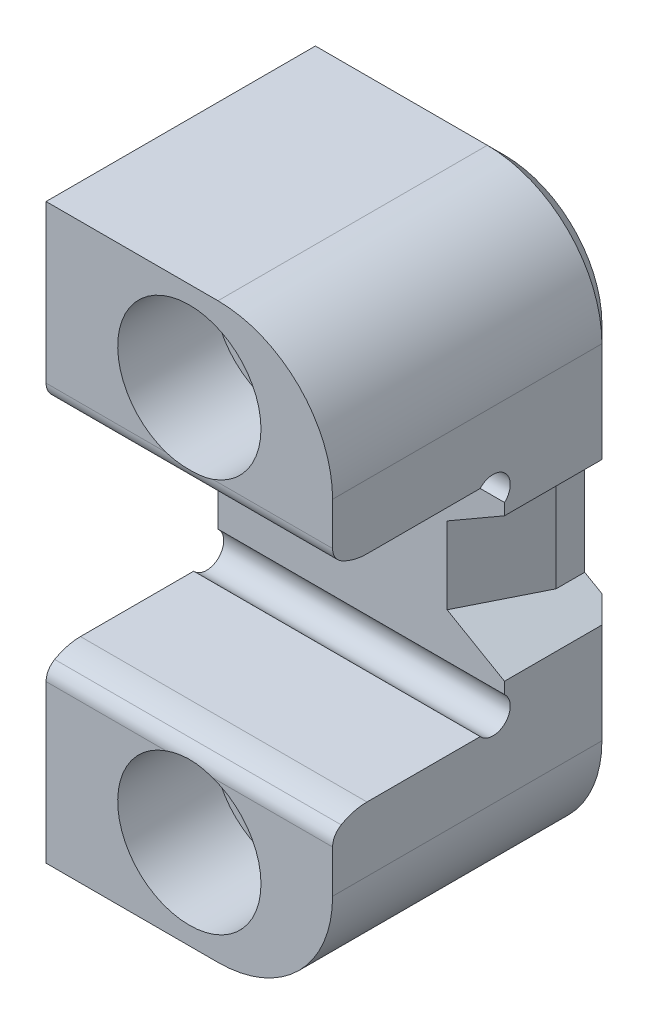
ISO-10303-21;
HEADER;
FILE_DESCRIPTION(('STEP AP214'),'2;1');
FILE_NAME('part.step','',(''),(''),'','','');
FILE_SCHEMA(('AUTOMOTIVE_DESIGN { 1 0 10303 214 1 1 1 1 }'));
ENDSEC;
DATA;
#1=APPLICATION_CONTEXT('core data for automotive mechanical design processes');
#2=APPLICATION_PROTOCOL_DEFINITION('international standard','automotive_design',2000,#1);
#3=PRODUCT_CONTEXT('',#1,'mechanical');
#4=PRODUCT('Part','Part','',(#3));
#5=PRODUCT_RELATED_PRODUCT_CATEGORY('part','',(#4));
#6=PRODUCT_DEFINITION_FORMATION('','',#4);
#7=PRODUCT_DEFINITION_CONTEXT('part definition',#1,'design');
#8=PRODUCT_DEFINITION('design','',#6,#7);
#9=PRODUCT_DEFINITION_SHAPE('','',#8);
#10=(LENGTH_UNIT() NAMED_UNIT(*) SI_UNIT(.MILLI.,.METRE.));
#11=(NAMED_UNIT(*) PLANE_ANGLE_UNIT() SI_UNIT($,.RADIAN.));
#12=(NAMED_UNIT(*) SI_UNIT($,.STERADIAN.) SOLID_ANGLE_UNIT());
#13=UNCERTAINTY_MEASURE_WITH_UNIT(LENGTH_MEASURE(1.E-05),#10,'distance_accuracy_value','');
#14=(GEOMETRIC_REPRESENTATION_CONTEXT(3) GLOBAL_UNCERTAINTY_ASSIGNED_CONTEXT((#13)) GLOBAL_UNIT_ASSIGNED_CONTEXT((#10,
#11,#12)) REPRESENTATION_CONTEXT('',''));
#15=CARTESIAN_POINT('',(0.,0.,0.));
#16=DIRECTION('',(0.,0.,1.));
#17=DIRECTION('',(1.,0.,0.));
#18=AXIS2_PLACEMENT_3D('',#15,#16,#17);
#19=CARTESIAN_POINT('',(6.35,0.,0.));
#20=DIRECTION('',(-1.,0.,0.));
#21=DIRECTION('',(0.,0.,1.));
#22=AXIS2_PLACEMENT_3D('',#19,#20,#21);
#23=PLANE('',#22);
#24=DIRECTION('',(0.,0.,1.));
#25=VECTOR('',#24,1.);
#26=CARTESIAN_POINT('',(6.35,3.175,-59.2806012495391));
#27=LINE('',#26,#25);
#28=CARTESIAN_POINT('',(6.35,3.175,-11.938));
#29=VERTEX_POINT('',#28);
#30=CARTESIAN_POINT('',(6.35,3.175,-7.62));
#31=VERTEX_POINT('',#30);
#32=EDGE_CURVE('E494',#29,#31,#27,.T.);
#33=ORIENTED_EDGE('',*,*,#32,.F.);
#34=DIRECTION('',(0.,1.,0.));
#35=VECTOR('',#34,1.);
#36=CARTESIAN_POINT('',(6.35,0.,-11.938));
#37=LINE('',#36,#35);
#38=CARTESIAN_POINT('',(6.35,7.62,-11.938));
#39=VERTEX_POINT('',#38);
#40=EDGE_CURVE('E310',#29,#39,#37,.T.);
#41=ORIENTED_EDGE('',*,*,#40,.T.);
#42=DIRECTION('',(0.,0.,1.));
#43=VECTOR('',#42,1.);
#44=CARTESIAN_POINT('',(6.35,7.62,0.));
#45=LINE('',#44,#43);
#46=CARTESIAN_POINT('',(6.35,7.62,0.));
#47=VERTEX_POINT('',#46);
#48=EDGE_CURVE('E275',#39,#47,#45,.T.);
#49=ORIENTED_EDGE('',*,*,#48,.T.);
#50=DIRECTION('',(0.,-1.,0.));
#51=VECTOR('',#50,1.);
#52=CARTESIAN_POINT('',(6.35,4.7625,0.));
#53=LINE('',#52,#51);
#54=CARTESIAN_POINT('',(6.35,5.72867728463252,0.));
#55=VERTEX_POINT('',#54);
#56=EDGE_CURVE('E246',#47,#55,#53,.T.);
#57=ORIENTED_EDGE('',*,*,#56,.T.);
#58=CARTESIAN_POINT('',(6.35,5.72867728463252,-0.762));
#59=DIRECTION('',(-1.,0.,0.));
#60=DIRECTION('',(0.,0.,1.));
#61=AXIS2_PLACEMENT_3D('',#58,#59,#60);
#62=CIRCLE('',#61,0.762);
#63=CARTESIAN_POINT('',(6.35,5.06876592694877,-0.381));
#64=VERTEX_POINT('',#63);
#65=EDGE_CURVE('E540',#64,#55,#62,.T.);
#66=ORIENTED_EDGE('',*,*,#65,.F.);
#67=CARTESIAN_POINT('',(6.35,7.0485,-1.524));
#68=DIRECTION('',(-1.,0.,0.));
#69=DIRECTION('',(0.,0.,1.));
#70=AXIS2_PLACEMENT_3D('',#67,#68,#69);
#71=CIRCLE('',#70,2.286);
#72=CARTESIAN_POINT('',(6.35,4.7625,-1.524));
#73=VERTEX_POINT('',#72);
#74=EDGE_CURVE('E532',#73,#64,#71,.T.);
#75=ORIENTED_EDGE('',*,*,#74,.F.);
#76=DIRECTION('',(0.,0.,-1.));
#77=VECTOR('',#76,1.);
#78=CARTESIAN_POINT('',(6.35,4.7625,0.));
#79=LINE('',#78,#77);
#80=CARTESIAN_POINT('',(6.35,4.7625,-6.54403873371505));
#81=VERTEX_POINT('',#80);
#82=EDGE_CURVE('E234',#73,#81,#79,.T.);
#83=ORIENTED_EDGE('',*,*,#82,.T.);
#84=CARTESIAN_POINT('',(6.35,4.2545,-7.112));
#85=DIRECTION('',(1.,0.,0.));
#86=DIRECTION('',(0.,0.,-1.));
#87=AXIS2_PLACEMENT_3D('',#84,#85,#86);
#88=CIRCLE('',#87,0.762);
#89=CARTESIAN_POINT('',(6.35,3.68653873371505,-7.62));
#90=VERTEX_POINT('',#89);
#91=EDGE_CURVE('E509',#90,#81,#88,.T.);
#92=ORIENTED_EDGE('',*,*,#91,.F.);
#93=DIRECTION('',(0.,-1.,0.));
#94=VECTOR('',#93,1.);
#95=CARTESIAN_POINT('',(6.35,4.7625,-7.62));
#96=LINE('',#95,#94);
#97=EDGE_CURVE('E233',#90,#31,#96,.T.);
#98=ORIENTED_EDGE('',*,*,#97,.T.);
#99=EDGE_LOOP('',(#33,#41,#49,#57,#66,#75,#83,#92,#98));
#100=FACE_BOUND('',#99,.T.);
#101=ADVANCED_FACE('F33',(#100),#23,.F.);
#102=DIRECTION('',(0.,0.,1.));
#103=VECTOR('',#102,1.);
#104=CARTESIAN_POINT('',(6.35,-3.175,-59.2806012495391));
#105=LINE('',#104,#103);
#106=CARTESIAN_POINT('',(6.35,-3.175,-11.938));
#107=VERTEX_POINT('',#106);
#108=CARTESIAN_POINT('',(6.35,-3.175,-7.62));
#109=VERTEX_POINT('',#108);
#110=EDGE_CURVE('E212',#107,#109,#105,.T.);
#111=ORIENTED_EDGE('',*,*,#110,.T.);
#112=CARTESIAN_POINT('',(6.35,-3.68653873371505,-7.62));
#113=VERTEX_POINT('',#112);
#114=EDGE_CURVE('E222',#109,#113,#96,.T.);
#115=ORIENTED_EDGE('',*,*,#114,.T.);
#116=CARTESIAN_POINT('',(6.35,-4.2545,-7.112));
#117=DIRECTION('',(1.,0.,0.));
#118=DIRECTION('',(0.,0.,1.));
#119=AXIS2_PLACEMENT_3D('',#116,#117,#118);
#120=CIRCLE('',#119,0.762);
#121=CARTESIAN_POINT('',(6.35,-4.7625,-6.54403873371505));
#122=VERTEX_POINT('',#121);
#123=EDGE_CURVE('E502',#122,#113,#120,.T.);
#124=ORIENTED_EDGE('',*,*,#123,.F.);
#125=DIRECTION('',(0.,0.,1.));
#126=VECTOR('',#125,1.);
#127=CARTESIAN_POINT('',(6.35,-4.7625,0.));
#128=LINE('',#127,#126);
#129=CARTESIAN_POINT('',(6.35,-4.7625,-1.524));
#130=VERTEX_POINT('',#129);
#131=EDGE_CURVE('E237',#122,#130,#128,.T.);
#132=ORIENTED_EDGE('',*,*,#131,.T.);
#133=CARTESIAN_POINT('',(6.35,-7.0485,-1.524));
#134=DIRECTION('',(-1.,0.,0.));
#135=DIRECTION('',(0.,0.,-1.));
#136=AXIS2_PLACEMENT_3D('',#133,#134,#135);
#137=CIRCLE('',#136,2.286);
#138=CARTESIAN_POINT('',(6.35,-5.06876592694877,-0.381));
#139=VERTEX_POINT('',#138);
#140=EDGE_CURVE('E517',#139,#130,#137,.T.);
#141=ORIENTED_EDGE('',*,*,#140,.F.);
#142=CARTESIAN_POINT('',(6.35,-5.72867728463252,-0.762));
#143=DIRECTION('',(-1.,0.,0.));
#144=DIRECTION('',(0.,0.,-1.));
#145=AXIS2_PLACEMENT_3D('',#142,#143,#144);
#146=CIRCLE('',#145,0.762);
#147=CARTESIAN_POINT('',(6.35,-5.72867728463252,0.));
#148=VERTEX_POINT('',#147);
#149=EDGE_CURVE('E520',#148,#139,#146,.T.);
#150=ORIENTED_EDGE('',*,*,#149,.F.);
#151=DIRECTION('',(0.,-1.,0.));
#152=VECTOR('',#151,1.);
#153=CARTESIAN_POINT('',(6.35,-4.7625,0.));
#154=LINE('',#153,#152);
#155=CARTESIAN_POINT('',(6.35,-7.62,0.));
#156=VERTEX_POINT('',#155);
#157=EDGE_CURVE('E244',#148,#156,#154,.T.);
#158=ORIENTED_EDGE('',*,*,#157,.T.);
#159=DIRECTION('',(0.,0.,-1.));
#160=VECTOR('',#159,1.);
#161=CARTESIAN_POINT('',(6.35,-7.62,0.));
#162=LINE('',#161,#160);
#163=CARTESIAN_POINT('',(6.35,-7.62,-11.938));
#164=VERTEX_POINT('',#163);
#165=EDGE_CURVE('E277',#156,#164,#162,.T.);
#166=ORIENTED_EDGE('',*,*,#165,.T.);
#167=EDGE_CURVE('E226',#164,#107,#37,.T.);
#168=ORIENTED_EDGE('',*,*,#167,.T.);
#169=EDGE_LOOP('',(#111,#115,#124,#132,#141,#150,#158,#166,#168));
#170=FACE_BOUND('',#169,.T.);
#171=ADVANCED_FACE('F220',(#170),#23,.F.);
#172=CARTESIAN_POINT('',(6.35,4.7625,-7.62));
#173=DIRECTION('',(0.,0.,-1.));
#174=DIRECTION('',(-1.,0.,0.));
#175=AXIS2_PLACEMENT_3D('',#172,#173,#174);
#176=PLANE('',#175);
#177=DIRECTION('',(0.86602540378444,-0.499999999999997,0.));
#178=VECTOR('',#177,1.);
#179=CARTESIAN_POINT('',(2.91296167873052,-1.19062500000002,-7.62));
#180=LINE('',#179,#178);
#181=CARTESIAN_POINT('',(3.80511357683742,-1.70570913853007,-7.62));
#182=VERTEX_POINT('',#181);
#183=EDGE_CURVE('E48',#182,#109,#180,.T.);
#184=ORIENTED_EDGE('',*,*,#183,.F.);
#185=DIRECTION('',(0.,1.,0.));
#186=VECTOR('',#185,1.);
#187=CARTESIAN_POINT('',(3.80511357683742,2.29511818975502,-7.62));
#188=LINE('',#187,#186);
#189=CARTESIAN_POINT('',(3.80511357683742,1.70570913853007,-7.62));
#190=VERTEX_POINT('',#189);
#191=EDGE_CURVE('E481',#182,#190,#188,.T.);
#192=ORIENTED_EDGE('',*,*,#191,.T.);
#193=DIRECTION('',(-0.86602540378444,-0.499999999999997,0.));
#194=VECTOR('',#193,1.);
#195=CARTESIAN_POINT('',(7.0374076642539,3.571875,-7.62));
#196=LINE('',#195,#194);
#197=EDGE_CURVE('E55',#31,#190,#196,.T.);
#198=ORIENTED_EDGE('',*,*,#197,.F.);
#199=ORIENTED_EDGE('',*,*,#97,.F.);
#200=DIRECTION('',(1.,0.,0.));
#201=VECTOR('',#200,1.);
#202=CARTESIAN_POINT('',(-6.35,3.68653873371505,-7.62));
#203=LINE('',#202,#201);
#204=CARTESIAN_POINT('',(-6.35,3.68653873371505,-7.62));
#205=VERTEX_POINT('',#204);
#206=EDGE_CURVE('E474',#90,#205,#203,.F.);
#207=ORIENTED_EDGE('',*,*,#206,.T.);
#208=DIRECTION('',(0.,-1.,0.));
#209=VECTOR('',#208,1.);
#210=CARTESIAN_POINT('',(-6.35,4.7625,-7.62));
#211=LINE('',#210,#209);
#212=CARTESIAN_POINT('',(-6.35,-3.68653873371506,-7.62));
#213=VERTEX_POINT('',#212);
#214=EDGE_CURVE('E253',#205,#213,#211,.T.);
#215=ORIENTED_EDGE('',*,*,#214,.T.);
#216=DIRECTION('',(1.,0.,0.));
#217=VECTOR('',#216,1.);
#218=CARTESIAN_POINT('',(-6.35,-3.68653873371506,-7.62));
#219=LINE('',#218,#217);
#220=EDGE_CURVE('E232',#213,#113,#219,.T.);
#221=ORIENTED_EDGE('',*,*,#220,.T.);
#222=ORIENTED_EDGE('',*,*,#114,.F.);
#223=EDGE_LOOP('',(#184,#192,#198,#199,#207,#215,#221,#222));
#224=FACE_BOUND('',#223,.T.);
#225=ADVANCED_FACE('F230',(#224),#176,.F.);
#226=CARTESIAN_POINT('',(6.35,12.7,-12.7));
#227=DIRECTION('',(0.,0.,1.));
#228=DIRECTION('',(1.,0.,0.));
#229=AXIS2_PLACEMENT_3D('',#226,#227,#228);
#230=PLANE('',#229);
#231=CARTESIAN_POINT('',(0.,-8.73125,-12.7));
#232=DIRECTION('',(0.,0.,1.));
#233=DIRECTION('',(1.,0.,0.));
#234=AXIS2_PLACEMENT_3D('',#231,#232,#233);
#235=CIRCLE('',#234,2.15265);
#236=CARTESIAN_POINT('',(2.15265,-8.73125,-12.7));
#237=VERTEX_POINT('',#236);
#238=EDGE_CURVE('E254',#237,#237,#235,.T.);
#239=ORIENTED_EDGE('',*,*,#238,.T.);
#240=EDGE_LOOP('',(#239));
#241=FACE_BOUND('',#240,.T.);
#242=CARTESIAN_POINT('',(0.,8.73125,-12.7));
#243=DIRECTION('',(0.,0.,1.));
#244=DIRECTION('',(1.,0.,0.));
#245=AXIS2_PLACEMENT_3D('',#242,#243,#244);
#246=CIRCLE('',#245,2.15265);
#247=CARTESIAN_POINT('',(2.15265,8.73125,-12.7));
#248=VERTEX_POINT('',#247);
#249=EDGE_CURVE('E563',#248,#248,#246,.T.);
#250=ORIENTED_EDGE('',*,*,#249,.T.);
#251=EDGE_LOOP('',(#250));
#252=FACE_BOUND('',#251,.T.);
#253=DIRECTION('',(0.86602540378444,0.499999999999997,0.));
#254=VECTOR('',#253,1.);
#255=CARTESIAN_POINT('',(10.4744459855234,5.55624999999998,-12.7));
#256=LINE('',#255,#254);
#257=CARTESIAN_POINT('',(4.826,2.29511818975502,-12.7));
#258=VERTEX_POINT('',#257);
#259=CARTESIAN_POINT('',(5.588,2.73505909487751,-12.7));
#260=VERTEX_POINT('',#259);
#261=EDGE_CURVE('E215',#258,#260,#256,.T.);
#262=ORIENTED_EDGE('',*,*,#261,.F.);
#263=DIRECTION('',(0.,1.,0.));
#264=VECTOR('',#263,1.);
#265=CARTESIAN_POINT('',(4.826,12.7,-12.7));
#266=LINE('',#265,#264);
#267=CARTESIAN_POINT('',(4.826,-2.29511818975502,-12.7));
#268=VERTEX_POINT('',#267);
#269=EDGE_CURVE('E472',#268,#258,#266,.T.);
#270=ORIENTED_EDGE('',*,*,#269,.F.);
#271=DIRECTION('',(-0.86602540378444,0.499999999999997,0.));
#272=VECTOR('',#271,1.);
#273=CARTESIAN_POINT('',(-0.524076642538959,0.793749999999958,-12.7));
#274=LINE('',#273,#272);
#275=CARTESIAN_POINT('',(5.588,-2.73505909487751,-12.7));
#276=VERTEX_POINT('',#275);
#277=EDGE_CURVE('E216',#276,#268,#274,.T.);
#278=ORIENTED_EDGE('',*,*,#277,.F.);
#279=DIRECTION('',(0.,-1.,0.));
#280=VECTOR('',#279,1.);
#281=CARTESIAN_POINT('',(5.588,12.7,-12.7));
#282=LINE('',#281,#280);
#283=CARTESIAN_POINT('',(5.588,-7.62,-12.7));
#284=VERTEX_POINT('',#283);
#285=EDGE_CURVE('E293',#276,#284,#282,.T.);
#286=ORIENTED_EDGE('',*,*,#285,.T.);
#287=CARTESIAN_POINT('',(1.27,-7.62,-12.7));
#288=DIRECTION('',(0.,0.,1.));
#289=DIRECTION('',(1.,0.,0.));
#290=AXIS2_PLACEMENT_3D('',#287,#288,#289);
#291=CIRCLE('',#290,4.318);
#292=CARTESIAN_POINT('',(1.27,-11.938,-12.7));
#293=VERTEX_POINT('',#292);
#294=EDGE_CURVE('E297',#284,#293,#291,.F.);
#295=ORIENTED_EDGE('',*,*,#294,.T.);
#296=DIRECTION('',(-1.,0.,0.));
#297=VECTOR('',#296,1.);
#298=CARTESIAN_POINT('',(6.35,-11.938,-12.7));
#299=LINE('',#298,#297);
#300=CARTESIAN_POINT('',(-6.35,-11.938,-12.7));
#301=VERTEX_POINT('',#300);
#302=EDGE_CURVE('E299',#293,#301,#299,.T.);
#303=ORIENTED_EDGE('',*,*,#302,.T.);
#304=DIRECTION('',(0.,1.,0.));
#305=VECTOR('',#304,1.);
#306=CARTESIAN_POINT('',(-6.35,12.7,-12.7));
#307=LINE('',#306,#305);
#308=CARTESIAN_POINT('',(-6.35,11.938,-12.7));
#309=VERTEX_POINT('',#308);
#310=EDGE_CURVE('E263',#301,#309,#307,.T.);
#311=ORIENTED_EDGE('',*,*,#310,.T.);
#312=DIRECTION('',(1.,0.,0.));
#313=VECTOR('',#312,1.);
#314=CARTESIAN_POINT('',(6.35,11.938,-12.7));
#315=LINE('',#314,#313);
#316=CARTESIAN_POINT('',(1.27,11.938,-12.7));
#317=VERTEX_POINT('',#316);
#318=EDGE_CURVE('E289',#309,#317,#315,.T.);
#319=ORIENTED_EDGE('',*,*,#318,.T.);
#320=CARTESIAN_POINT('',(1.27,7.62,-12.7));
#321=DIRECTION('',(0.,0.,1.));
#322=DIRECTION('',(1.,0.,0.));
#323=AXIS2_PLACEMENT_3D('',#320,#321,#322);
#324=CIRCLE('',#323,4.318);
#325=CARTESIAN_POINT('',(5.588,7.62,-12.7));
#326=VERTEX_POINT('',#325);
#327=EDGE_CURVE('E291',#317,#326,#324,.F.);
#328=ORIENTED_EDGE('',*,*,#327,.T.);
#329=EDGE_CURVE('E294',#326,#260,#282,.T.);
#330=ORIENTED_EDGE('',*,*,#329,.T.);
#331=EDGE_LOOP('',(#262,#270,#278,#286,#295,#303,#311,#319,#328,#330));
#332=FACE_BOUND('',#331,.T.);
#333=ADVANCED_FACE('F391',(#241,#252,#332),#230,.F.);
#334=CARTESIAN_POINT('',(6.35,0.,-11.938));
#335=DIRECTION('',(-0.707106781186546,0.,0.707106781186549));
#336=DIRECTION('',(0.,1.,0.));
#337=AXIS2_PLACEMENT_3D('',#334,#335,#336);
#338=PLANE('',#337);
#339=ORIENTED_EDGE('',*,*,#40,.F.);
#340=DIRECTION('',(0.654653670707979,0.377964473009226,0.654653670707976));
#341=VECTOR('',#340,1.);
#342=CARTESIAN_POINT('',(5.56439124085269,2.72142857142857,-12.7236087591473));
#343=LINE('',#342,#341);
#344=EDGE_CURVE('E469',#29,#260,#343,.F.);
#345=ORIENTED_EDGE('',*,*,#344,.T.);
#346=ORIENTED_EDGE('',*,*,#329,.F.);
#347=DIRECTION('',(0.707106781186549,0.,0.707106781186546));
#348=VECTOR('',#347,1.);
#349=CARTESIAN_POINT('',(5.588,7.62,-12.7));
#350=LINE('',#349,#348);
#351=EDGE_CURVE('E324',#326,#39,#350,.T.);
#352=ORIENTED_EDGE('',*,*,#351,.T.);
#353=EDGE_LOOP('',(#339,#345,#346,#352));
#354=FACE_BOUND('',#353,.T.);
#355=ADVANCED_FACE('F394',(#354),#338,.F.);
#356=ORIENTED_EDGE('',*,*,#285,.F.);
#357=DIRECTION('',(-0.654653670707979,0.377964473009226,-0.654653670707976));
#358=VECTOR('',#357,1.);
#359=CARTESIAN_POINT('',(5.56439124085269,-2.72142857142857,-12.7236087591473));
#360=LINE('',#359,#358);
#361=EDGE_CURVE('E467',#276,#107,#360,.F.);
#362=ORIENTED_EDGE('',*,*,#361,.T.);
#363=ORIENTED_EDGE('',*,*,#167,.F.);
#364=DIRECTION('',(0.707106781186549,0.,0.707106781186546));
#365=VECTOR('',#364,1.);
#366=CARTESIAN_POINT('',(5.588,-7.62,-12.7));
#367=LINE('',#366,#365);
#368=EDGE_CURVE('E320',#284,#164,#367,.T.);
#369=ORIENTED_EDGE('',*,*,#368,.F.);
#370=EDGE_LOOP('',(#356,#362,#363,#369));
#371=FACE_BOUND('',#370,.T.);
#372=ADVANCED_FACE('F405',(#371),#338,.F.);
#373=CARTESIAN_POINT('',(6.35,-4.7625,0.));
#374=DIRECTION('',(0.,-1.,0.));
#375=DIRECTION('',(0.,0.,-1.));
#376=AXIS2_PLACEMENT_3D('',#373,#374,#375);
#377=PLANE('',#376);
#378=ORIENTED_EDGE('',*,*,#131,.F.);
#379=DIRECTION('',(1.,0.,0.));
#380=VECTOR('',#379,1.);
#381=CARTESIAN_POINT('',(-6.35,-4.7625,-6.54403873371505));
#382=LINE('',#381,#380);
#383=CARTESIAN_POINT('',(-6.35,-4.7625,-6.54403873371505));
#384=VERTEX_POINT('',#383);
#385=EDGE_CURVE('E505',#122,#384,#382,.F.);
#386=ORIENTED_EDGE('',*,*,#385,.T.);
#387=DIRECTION('',(0.,0.,1.));
#388=VECTOR('',#387,1.);
#389=CARTESIAN_POINT('',(-6.35,-4.7625,0.));
#390=LINE('',#389,#388);
#391=CARTESIAN_POINT('',(-6.35,-4.7625,-1.524));
#392=VERTEX_POINT('',#391);
#393=EDGE_CURVE('E256',#384,#392,#390,.T.);
#394=ORIENTED_EDGE('',*,*,#393,.T.);
#395=DIRECTION('',(1.,0.,0.));
#396=VECTOR('',#395,1.);
#397=CARTESIAN_POINT('',(-6.35,-4.7625,-1.524));
#398=LINE('',#397,#396);
#399=EDGE_CURVE('E529',#392,#130,#398,.T.);
#400=ORIENTED_EDGE('',*,*,#399,.T.);
#401=EDGE_LOOP('',(#378,#386,#394,#400));
#402=FACE_BOUND('',#401,.T.);
#403=ADVANCED_FACE('F383',(#402),#377,.F.);
#404=CARTESIAN_POINT('',(6.35,4.7625,0.));
#405=DIRECTION('',(0.,0.,-1.));
#406=DIRECTION('',(-1.,0.,0.));
#407=AXIS2_PLACEMENT_3D('',#404,#405,#406);
#408=PLANE('',#407);
#409=DIRECTION('',(1.,0.,0.));
#410=VECTOR('',#409,1.);
#411=CARTESIAN_POINT('',(-6.35,5.72867728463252,0.));
#412=LINE('',#411,#410);
#413=CARTESIAN_POINT('',(1.03207659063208,5.72867728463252,0.));
#414=VERTEX_POINT('',#413);
#415=EDGE_CURVE('E551',#414,#55,#412,.T.);
#416=ORIENTED_EDGE('',*,*,#415,.T.);
#417=ORIENTED_EDGE('',*,*,#56,.F.);
#418=CARTESIAN_POINT('',(1.27,7.62,0.));
#419=DIRECTION('',(0.,0.,-1.));
#420=DIRECTION('',(-1.,0.,0.));
#421=AXIS2_PLACEMENT_3D('',#418,#419,#420);
#422=CIRCLE('',#421,5.08);
#423=CARTESIAN_POINT('',(1.27,12.7,0.));
#424=VERTEX_POINT('',#423);
#425=EDGE_CURVE('E284',#47,#424,#422,.F.);
#426=ORIENTED_EDGE('',*,*,#425,.T.);
#427=DIRECTION('',(-1.,0.,0.));
#428=VECTOR('',#427,1.);
#429=CARTESIAN_POINT('',(6.35,12.7,0.));
#430=LINE('',#429,#428);
#431=CARTESIAN_POINT('',(-6.35,12.7,0.));
#432=VERTEX_POINT('',#431);
#433=EDGE_CURVE('E249',#424,#432,#430,.T.);
#434=ORIENTED_EDGE('',*,*,#433,.T.);
#435=DIRECTION('',(0.,-1.,0.));
#436=VECTOR('',#435,1.);
#437=CARTESIAN_POINT('',(-6.35,4.7625,0.));
#438=LINE('',#437,#436);
#439=CARTESIAN_POINT('',(-6.35,5.72867728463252,0.));
#440=VERTEX_POINT('',#439);
#441=EDGE_CURVE('E239',#432,#440,#438,.T.);
#442=ORIENTED_EDGE('',*,*,#441,.T.);
#443=CARTESIAN_POINT('',(-1.03207659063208,5.72867728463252,0.));
#444=VERTEX_POINT('',#443);
#445=EDGE_CURVE('E321',#440,#444,#412,.T.);
#446=ORIENTED_EDGE('',*,*,#445,.T.);
#447=CARTESIAN_POINT('',(0.,8.73125,0.));
#448=DIRECTION('',(0.,0.,1.));
#449=DIRECTION('',(1.,0.,0.));
#450=AXIS2_PLACEMENT_3D('',#447,#448,#449);
#451=CIRCLE('',#450,3.175);
#452=EDGE_CURVE('E330',#414,#444,#451,.T.);
#453=ORIENTED_EDGE('',*,*,#452,.F.);
#454=EDGE_LOOP('',(#416,#417,#426,#434,#442,#446,#453));
#455=FACE_BOUND('',#454,.T.);
#456=ADVANCED_FACE('F379',(#455),#408,.F.);
#457=CARTESIAN_POINT('',(-6.35,0.,0.));
#458=DIRECTION('',(-1.,0.,0.));
#459=DIRECTION('',(0.,0.,1.));
#460=AXIS2_PLACEMENT_3D('',#457,#458,#459);
#461=PLANE('',#460);
#462=CARTESIAN_POINT('',(-6.35,-4.2545,-7.112));
#463=DIRECTION('',(1.,0.,0.));
#464=DIRECTION('',(0.,0.,1.));
#465=AXIS2_PLACEMENT_3D('',#462,#463,#464);
#466=CIRCLE('',#465,0.762);
#467=EDGE_CURVE('E503',#384,#213,#466,.T.);
#468=ORIENTED_EDGE('',*,*,#467,.T.);
#469=ORIENTED_EDGE('',*,*,#214,.F.);
#470=CARTESIAN_POINT('',(-6.35,4.2545,-7.112));
#471=DIRECTION('',(1.,0.,0.));
#472=DIRECTION('',(0.,0.,-1.));
#473=AXIS2_PLACEMENT_3D('',#470,#471,#472);
#474=CIRCLE('',#473,0.762);
#475=CARTESIAN_POINT('',(-6.35,4.7625,-6.54403873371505));
#476=VERTEX_POINT('',#475);
#477=EDGE_CURVE('E510',#205,#476,#474,.T.);
#478=ORIENTED_EDGE('',*,*,#477,.T.);
#479=DIRECTION('',(0.,0.,-1.));
#480=VECTOR('',#479,1.);
#481=CARTESIAN_POINT('',(-6.35,4.7625,0.));
#482=LINE('',#481,#480);
#483=CARTESIAN_POINT('',(-6.35,4.7625,-1.524));
#484=VERTEX_POINT('',#483);
#485=EDGE_CURVE('E250',#484,#476,#482,.T.);
#486=ORIENTED_EDGE('',*,*,#485,.F.);
#487=CARTESIAN_POINT('',(-6.35,7.0485,-1.524));
#488=DIRECTION('',(-1.,0.,0.));
#489=DIRECTION('',(0.,0.,1.));
#490=AXIS2_PLACEMENT_3D('',#487,#488,#489);
#491=CIRCLE('',#490,2.286);
#492=CARTESIAN_POINT('',(-6.35,5.06876592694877,-0.381));
#493=VERTEX_POINT('',#492);
#494=EDGE_CURVE('E542',#484,#493,#491,.T.);
#495=ORIENTED_EDGE('',*,*,#494,.T.);
#496=CARTESIAN_POINT('',(-6.35,5.72867728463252,-0.762));
#497=DIRECTION('',(-1.,0.,0.));
#498=DIRECTION('',(0.,0.,1.));
#499=AXIS2_PLACEMENT_3D('',#496,#497,#498);
#500=CIRCLE('',#499,0.762);
#501=EDGE_CURVE('E545',#493,#440,#500,.T.);
#502=ORIENTED_EDGE('',*,*,#501,.T.);
#503=ORIENTED_EDGE('',*,*,#441,.F.);
#504=DIRECTION('',(0.,0.,1.));
#505=VECTOR('',#504,1.);
#506=CARTESIAN_POINT('',(-6.35,12.7,0.));
#507=LINE('',#506,#505);
#508=CARTESIAN_POINT('',(-6.35,12.7,-11.938));
#509=VERTEX_POINT('',#508);
#510=EDGE_CURVE('E266',#509,#432,#507,.T.);
#511=ORIENTED_EDGE('',*,*,#510,.F.);
#512=DIRECTION('',(0.,0.707106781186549,0.707106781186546));
#513=VECTOR('',#512,1.);
#514=CARTESIAN_POINT('',(-6.35,12.319,-12.319));
#515=LINE('',#514,#513);
#516=EDGE_CURVE('E302',#509,#309,#515,.F.);
#517=ORIENTED_EDGE('',*,*,#516,.T.);
#518=ORIENTED_EDGE('',*,*,#310,.F.);
#519=DIRECTION('',(0.,0.707106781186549,-0.707106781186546));
#520=VECTOR('',#519,1.);
#521=CARTESIAN_POINT('',(-6.35,-12.319,-12.319));
#522=LINE('',#521,#520);
#523=CARTESIAN_POINT('',(-6.35,-12.7,-11.938));
#524=VERTEX_POINT('',#523);
#525=EDGE_CURVE('E304',#301,#524,#522,.F.);
#526=ORIENTED_EDGE('',*,*,#525,.T.);
#527=DIRECTION('',(0.,0.,-1.));
#528=VECTOR('',#527,1.);
#529=CARTESIAN_POINT('',(-6.35,-12.7,0.));
#530=LINE('',#529,#528);
#531=CARTESIAN_POINT('',(-6.35,-12.7,0.));
#532=VERTEX_POINT('',#531);
#533=EDGE_CURVE('E260',#532,#524,#530,.T.);
#534=ORIENTED_EDGE('',*,*,#533,.F.);
#535=DIRECTION('',(0.,-1.,0.));
#536=VECTOR('',#535,1.);
#537=CARTESIAN_POINT('',(-6.35,-4.7625,0.));
#538=LINE('',#537,#536);
#539=CARTESIAN_POINT('',(-6.35,-5.72867728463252,0.));
#540=VERTEX_POINT('',#539);
#541=EDGE_CURVE('E258',#540,#532,#538,.T.);
#542=ORIENTED_EDGE('',*,*,#541,.F.);
#543=CARTESIAN_POINT('',(-6.35,-5.72867728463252,-0.762));
#544=DIRECTION('',(-1.,0.,0.));
#545=DIRECTION('',(0.,0.,-1.));
#546=AXIS2_PLACEMENT_3D('',#543,#544,#545);
#547=CIRCLE('',#546,0.762);
#548=CARTESIAN_POINT('',(-6.35,-5.06876592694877,-0.381));
#549=VERTEX_POINT('',#548);
#550=EDGE_CURVE('E526',#540,#549,#547,.T.);
#551=ORIENTED_EDGE('',*,*,#550,.T.);
#552=CARTESIAN_POINT('',(-6.35,-7.0485,-1.524));
#553=DIRECTION('',(-1.,0.,0.));
#554=DIRECTION('',(0.,0.,-1.));
#555=AXIS2_PLACEMENT_3D('',#552,#553,#554);
#556=CIRCLE('',#555,2.286);
#557=EDGE_CURVE('E523',#549,#392,#556,.T.);
#558=ORIENTED_EDGE('',*,*,#557,.T.);
#559=ORIENTED_EDGE('',*,*,#393,.F.);
#560=EDGE_LOOP('',(#468,#469,#478,#486,#495,#502,#503,#511,#517,#518,#526,#534,#542,#551,#558,#559));
#561=FACE_BOUND('',#560,.T.);
#562=ADVANCED_FACE('F375',(#561),#461,.T.);
#563=CARTESIAN_POINT('',(6.35,4.7625,0.));
#564=DIRECTION('',(0.,1.,0.));
#565=DIRECTION('',(0.,0.,1.));
#566=AXIS2_PLACEMENT_3D('',#563,#564,#565);
#567=PLANE('',#566);
#568=ORIENTED_EDGE('',*,*,#485,.T.);
#569=DIRECTION('',(1.,0.,0.));
#570=VECTOR('',#569,1.);
#571=CARTESIAN_POINT('',(-6.35,4.7625,-6.54403873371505));
#572=LINE('',#571,#570);
#573=EDGE_CURVE('E513',#476,#81,#572,.T.);
#574=ORIENTED_EDGE('',*,*,#573,.T.);
#575=ORIENTED_EDGE('',*,*,#82,.F.);
#576=DIRECTION('',(1.,0.,0.));
#577=VECTOR('',#576,1.);
#578=CARTESIAN_POINT('',(-6.35,4.7625,-1.524));
#579=LINE('',#578,#577);
#580=EDGE_CURVE('E548',#484,#73,#579,.T.);
#581=ORIENTED_EDGE('',*,*,#580,.F.);
#582=EDGE_LOOP('',(#568,#574,#575,#581));
#583=FACE_BOUND('',#582,.T.);
#584=ADVANCED_FACE('F378',(#583),#567,.F.);
#585=CARTESIAN_POINT('',(6.35,-4.7625,0.));
#586=DIRECTION('',(0.,0.,-1.));
#587=DIRECTION('',(-1.,0.,0.));
#588=AXIS2_PLACEMENT_3D('',#585,#586,#587);
#589=PLANE('',#588);
#590=ORIENTED_EDGE('',*,*,#157,.F.);
#591=DIRECTION('',(1.,0.,0.));
#592=VECTOR('',#591,1.);
#593=CARTESIAN_POINT('',(-6.35,-5.72867728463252,0.));
#594=LINE('',#593,#592);
#595=CARTESIAN_POINT('',(1.03207659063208,-5.72867728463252,0.));
#596=VERTEX_POINT('',#595);
#597=EDGE_CURVE('E535',#596,#148,#594,.T.);
#598=ORIENTED_EDGE('',*,*,#597,.F.);
#599=CARTESIAN_POINT('',(0.,-8.73125,0.));
#600=DIRECTION('',(0.,0.,1.));
#601=DIRECTION('',(1.,0.,0.));
#602=AXIS2_PLACEMENT_3D('',#599,#600,#601);
#603=CIRCLE('',#602,3.175);
#604=CARTESIAN_POINT('',(-1.03207659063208,-5.72867728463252,0.));
#605=VERTEX_POINT('',#604);
#606=EDGE_CURVE('E566',#605,#596,#603,.T.);
#607=ORIENTED_EDGE('',*,*,#606,.F.);
#608=EDGE_CURVE('E533',#540,#605,#594,.T.);
#609=ORIENTED_EDGE('',*,*,#608,.F.);
#610=ORIENTED_EDGE('',*,*,#541,.T.);
#611=DIRECTION('',(-1.,0.,0.));
#612=VECTOR('',#611,1.);
#613=CARTESIAN_POINT('',(6.35,-12.7,0.));
#614=LINE('',#613,#612);
#615=CARTESIAN_POINT('',(1.27,-12.7,0.));
#616=VERTEX_POINT('',#615);
#617=EDGE_CURVE('E272',#616,#532,#614,.T.);
#618=ORIENTED_EDGE('',*,*,#617,.F.);
#619=CARTESIAN_POINT('',(1.27,-7.62,0.));
#620=DIRECTION('',(0.,0.,-1.));
#621=DIRECTION('',(-1.,0.,0.));
#622=AXIS2_PLACEMENT_3D('',#619,#620,#621);
#623=CIRCLE('',#622,5.08);
#624=EDGE_CURVE('E281',#616,#156,#623,.F.);
#625=ORIENTED_EDGE('',*,*,#624,.T.);
#626=EDGE_LOOP('',(#590,#598,#607,#609,#610,#618,#625));
#627=FACE_BOUND('',#626,.T.);
#628=ADVANCED_FACE('F398',(#627),#589,.F.);
#629=CARTESIAN_POINT('',(6.35,-12.7,0.));
#630=DIRECTION('',(0.,1.,0.));
#631=DIRECTION('',(0.,0.,1.));
#632=AXIS2_PLACEMENT_3D('',#629,#630,#631);
#633=PLANE('',#632);
#634=ORIENTED_EDGE('',*,*,#533,.T.);
#635=DIRECTION('',(1.,0.,0.));
#636=VECTOR('',#635,1.);
#637=CARTESIAN_POINT('',(6.35,-12.7,-11.938));
#638=LINE('',#637,#636);
#639=CARTESIAN_POINT('',(1.27,-12.7,-11.938));
#640=VERTEX_POINT('',#639);
#641=EDGE_CURVE('E306',#524,#640,#638,.T.);
#642=ORIENTED_EDGE('',*,*,#641,.T.);
#643=DIRECTION('',(0.,0.,-1.));
#644=VECTOR('',#643,1.);
#645=CARTESIAN_POINT('',(1.27,-12.7,0.));
#646=LINE('',#645,#644);
#647=EDGE_CURVE('E279',#640,#616,#646,.F.);
#648=ORIENTED_EDGE('',*,*,#647,.T.);
#649=ORIENTED_EDGE('',*,*,#617,.T.);
#650=EDGE_LOOP('',(#634,#642,#648,#649));
#651=FACE_BOUND('',#650,.T.);
#652=ADVANCED_FACE('F389',(#651),#633,.F.);
#653=CARTESIAN_POINT('',(6.35,12.7,0.));
#654=DIRECTION('',(0.,-1.,0.));
#655=DIRECTION('',(0.,0.,-1.));
#656=AXIS2_PLACEMENT_3D('',#653,#654,#655);
#657=PLANE('',#656);
#658=DIRECTION('',(0.,0.,1.));
#659=VECTOR('',#658,1.);
#660=CARTESIAN_POINT('',(1.27,12.7,0.));
#661=LINE('',#660,#659);
#662=CARTESIAN_POINT('',(1.27,12.7,-11.938));
#663=VERTEX_POINT('',#662);
#664=EDGE_CURVE('E286',#424,#663,#661,.F.);
#665=ORIENTED_EDGE('',*,*,#664,.T.);
#666=DIRECTION('',(-1.,0.,0.));
#667=VECTOR('',#666,1.);
#668=CARTESIAN_POINT('',(6.35,12.7,-11.938));
#669=LINE('',#668,#667);
#670=EDGE_CURVE('E314',#663,#509,#669,.T.);
#671=ORIENTED_EDGE('',*,*,#670,.T.);
#672=ORIENTED_EDGE('',*,*,#510,.T.);
#673=ORIENTED_EDGE('',*,*,#433,.F.);
#674=EDGE_LOOP('',(#665,#671,#672,#673));
#675=FACE_BOUND('',#674,.T.);
#676=ADVANCED_FACE('F385',(#675),#657,.F.);
#677=CARTESIAN_POINT('',(1.27,-7.62,0.));
#678=DIRECTION('',(0.,0.,-1.));
#679=DIRECTION('',(-1.,0.,0.));
#680=AXIS2_PLACEMENT_3D('',#677,#678,#679);
#681=CYLINDRICAL_SURFACE('',#680,5.08);
#682=ORIENTED_EDGE('',*,*,#647,.F.);
#683=CARTESIAN_POINT('',(1.27,-7.62,-11.938));
#684=DIRECTION('',(0.,0.,1.));
#685=DIRECTION('',(1.,0.,0.));
#686=AXIS2_PLACEMENT_3D('',#683,#684,#685);
#687=CIRCLE('',#686,5.08);
#688=EDGE_CURVE('E308',#640,#164,#687,.T.);
#689=ORIENTED_EDGE('',*,*,#688,.T.);
#690=ORIENTED_EDGE('',*,*,#165,.F.);
#691=ORIENTED_EDGE('',*,*,#624,.F.);
#692=EDGE_LOOP('',(#682,#689,#690,#691));
#693=FACE_BOUND('',#692,.T.);
#694=ADVANCED_FACE('F388',(#693),#681,.T.);
#695=CARTESIAN_POINT('',(1.27,7.62,0.));
#696=DIRECTION('',(0.,0.,1.));
#697=DIRECTION('',(1.,0.,0.));
#698=AXIS2_PLACEMENT_3D('',#695,#696,#697);
#699=CYLINDRICAL_SURFACE('',#698,5.08);
#700=ORIENTED_EDGE('',*,*,#48,.F.);
#701=CARTESIAN_POINT('',(1.27,7.62,-11.938));
#702=DIRECTION('',(0.,0.,1.));
#703=DIRECTION('',(1.,0.,0.));
#704=AXIS2_PLACEMENT_3D('',#701,#702,#703);
#705=CIRCLE('',#704,5.08);
#706=EDGE_CURVE('E312',#39,#663,#705,.T.);
#707=ORIENTED_EDGE('',*,*,#706,.T.);
#708=ORIENTED_EDGE('',*,*,#664,.F.);
#709=ORIENTED_EDGE('',*,*,#425,.F.);
#710=EDGE_LOOP('',(#700,#707,#708,#709));
#711=FACE_BOUND('',#710,.T.);
#712=ADVANCED_FACE('F414',(#711),#699,.T.);
#713=CARTESIAN_POINT('',(0.,-8.73125,0.));
#714=DIRECTION('',(0.,0.,1.));
#715=DIRECTION('',(1.,0.,0.));
#716=AXIS2_PLACEMENT_3D('',#713,#714,#715);
#717=CYLINDRICAL_SURFACE('',#716,2.15265);
#718=ORIENTED_EDGE('',*,*,#238,.F.);
#719=EDGE_LOOP('',(#718));
#720=FACE_BOUND('',#719,.T.);
#721=CARTESIAN_POINT('',(0.,-8.73125,-4.2672));
#722=DIRECTION('',(0.,0.,1.));
#723=DIRECTION('',(1.,0.,0.));
#724=AXIS2_PLACEMENT_3D('',#721,#722,#723);
#725=CIRCLE('',#724,2.15265);
#726=CARTESIAN_POINT('',(2.15265,-8.73125,-4.2672));
#727=VERTEX_POINT('',#726);
#728=EDGE_CURVE('E572',#727,#727,#725,.T.);
#729=ORIENTED_EDGE('',*,*,#728,.T.);
#730=EDGE_LOOP('',(#729));
#731=FACE_BOUND('',#730,.T.);
#732=ADVANCED_FACE('F373',(#720,#731),#717,.F.);
#733=CARTESIAN_POINT('',(2.15265,-8.73125,-4.2672));
#734=DIRECTION('',(0.,0.,-1.));
#735=DIRECTION('',(-1.,0.,0.));
#736=AXIS2_PLACEMENT_3D('',#733,#734,#735);
#737=PLANE('',#736);
#738=ORIENTED_EDGE('',*,*,#728,.F.);
#739=EDGE_LOOP('',(#738));
#740=FACE_BOUND('',#739,.T.);
#741=CARTESIAN_POINT('',(0.,-8.73125,-4.2672));
#742=DIRECTION('',(0.,0.,1.));
#743=DIRECTION('',(1.,0.,0.));
#744=AXIS2_PLACEMENT_3D('',#741,#742,#743);
#745=CIRCLE('',#744,3.175);
#746=CARTESIAN_POINT('',(3.175,-8.73125,-4.2672));
#747=VERTEX_POINT('',#746);
#748=EDGE_CURVE('E569',#747,#747,#745,.T.);
#749=ORIENTED_EDGE('',*,*,#748,.T.);
#750=EDGE_LOOP('',(#749));
#751=FACE_BOUND('',#750,.T.);
#752=ADVANCED_FACE('F580',(#740,#751),#737,.F.);
#753=CARTESIAN_POINT('',(0.,-8.73125,0.));
#754=DIRECTION('',(0.,0.,1.));
#755=DIRECTION('',(1.,0.,0.));
#756=AXIS2_PLACEMENT_3D('',#753,#754,#755);
#757=CYLINDRICAL_SURFACE('',#756,3.175);
#758=ORIENTED_EDGE('',*,*,#748,.F.);
#759=EDGE_LOOP('',(#758));
#760=FACE_BOUND('',#759,.T.);
#761=ORIENTED_EDGE('',*,*,#606,.T.);
#762=CARTESIAN_POINT('',(1.03207659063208,-5.72867728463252,0.));
#763=CARTESIAN_POINT('',(0.989627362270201,-5.71408615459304,-4.89166105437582E-06));
#764=CARTESIAN_POINT('',(0.946877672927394,-5.70039847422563,-0.000418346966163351));
#765=CARTESIAN_POINT('',(0.860847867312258,-5.67485022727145,-0.00179499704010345));
#766=CARTESIAN_POINT('',(0.817567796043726,-5.66298950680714,-0.00275814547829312));
#767=CARTESIAN_POINT('',(0.687028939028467,-5.63017514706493,-0.00607120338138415));
#768=CARTESIAN_POINT('',(0.599069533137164,-5.61198863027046,-0.00884475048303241));
#769=CARTESIAN_POINT('',(0.424347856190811,-5.58352463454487,-0.0138174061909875));
#770=CARTESIAN_POINT('',(0.337618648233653,-5.57304442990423,-0.0160301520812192));
#771=CARTESIAN_POINT('',(0.16358121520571,-5.55926610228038,-0.0190365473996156));
#772=CARTESIAN_POINT('',(0.0762731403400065,-5.5559661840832,-0.0198305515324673));
#773=CARTESIAN_POINT('',(-0.0965303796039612,-5.55656587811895,-0.0196919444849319));
#774=CARTESIAN_POINT('',(-0.18202639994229,-5.5603197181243,-0.0187942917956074));
#775=CARTESIAN_POINT('',(-0.352424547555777,-5.57471142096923,-0.0156810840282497));
#776=CARTESIAN_POINT('',(-0.437326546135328,-5.58535073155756,-0.0134652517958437));
#777=CARTESIAN_POINT('',(-0.60831855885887,-5.61383291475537,-0.00856139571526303));
#778=CARTESIAN_POINT('',(-0.694376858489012,-5.6318661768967,-0.0058620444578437));
#779=CARTESIAN_POINT('',(-0.822115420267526,-5.6642185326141,-0.00265495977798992));
#780=CARTESIAN_POINT('',(-0.864471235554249,-5.6758867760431,-0.0017262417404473));
#781=CARTESIAN_POINT('',(-0.948672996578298,-5.70097373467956,-0.000400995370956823));
#782=CARTESIAN_POINT('',(-0.990518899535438,-5.7143925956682,-4.51139142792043E-06));
#783=CARTESIAN_POINT('',(-1.03207659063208,-5.72867728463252,0.));
#784=B_SPLINE_CURVE_WITH_KNOTS('',3,(#762,#763,#764,#765,#766,#767,#768,#769,#770,#771,#772,
#773,#774,#775,#776,#777,#778,#779,#780,#781,#782,#783),.UNSPECIFIED.,.F.,.F.,(4,2,2,2,2,2,2,2,
2,2,4),(0.,0.134632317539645,0.269253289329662,0.538488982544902,0.800360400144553,
1.06216633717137,1.31862123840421,1.57513007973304,1.83870599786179,1.97050097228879,
2.10230692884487),.UNSPECIFIED.);
#785=EDGE_CURVE('E337',#596,#605,#784,.T.);
#786=ORIENTED_EDGE('',*,*,#785,.T.);
#787=EDGE_LOOP('',(#761,#786));
#788=FACE_BOUND('',#787,.T.);
#789=ADVANCED_FACE('F585',(#760,#788),#757,.F.);
#790=CARTESIAN_POINT('',(0.,8.73125,0.));
#791=DIRECTION('',(0.,0.,1.));
#792=DIRECTION('',(1.,0.,0.));
#793=AXIS2_PLACEMENT_3D('',#790,#791,#792);
#794=CYLINDRICAL_SURFACE('',#793,2.15265);
#795=ORIENTED_EDGE('',*,*,#249,.F.);
#796=EDGE_LOOP('',(#795));
#797=FACE_BOUND('',#796,.T.);
#798=CARTESIAN_POINT('',(0.,8.73125,-4.2672));
#799=DIRECTION('',(0.,0.,1.));
#800=DIRECTION('',(1.,0.,0.));
#801=AXIS2_PLACEMENT_3D('',#798,#799,#800);
#802=CIRCLE('',#801,2.15265);
#803=CARTESIAN_POINT('',(2.15265,8.73125,-4.2672));
#804=VERTEX_POINT('',#803);
#805=EDGE_CURVE('E560',#804,#804,#802,.T.);
#806=ORIENTED_EDGE('',*,*,#805,.T.);
#807=EDGE_LOOP('',(#806));
#808=FACE_BOUND('',#807,.T.);
#809=ADVANCED_FACE('F590',(#797,#808),#794,.F.);
#810=CARTESIAN_POINT('',(2.15265,8.73125,-4.2672));
#811=DIRECTION('',(0.,0.,-1.));
#812=DIRECTION('',(-1.,0.,0.));
#813=AXIS2_PLACEMENT_3D('',#810,#811,#812);
#814=PLANE('',#813);
#815=ORIENTED_EDGE('',*,*,#805,.F.);
#816=EDGE_LOOP('',(#815));
#817=FACE_BOUND('',#816,.T.);
#818=CARTESIAN_POINT('',(0.,8.73125,-4.2672));
#819=DIRECTION('',(0.,0.,1.));
#820=DIRECTION('',(1.,0.,0.));
#821=AXIS2_PLACEMENT_3D('',#818,#819,#820);
#822=CIRCLE('',#821,3.175);
#823=CARTESIAN_POINT('',(3.175,8.73125,-4.2672));
#824=VERTEX_POINT('',#823);
#825=EDGE_CURVE('E557',#824,#824,#822,.T.);
#826=ORIENTED_EDGE('',*,*,#825,.T.);
#827=EDGE_LOOP('',(#826));
#828=FACE_BOUND('',#827,.T.);
#829=ADVANCED_FACE('F438',(#817,#828),#814,.F.);
#830=CARTESIAN_POINT('',(0.,8.73125,0.));
#831=DIRECTION('',(0.,0.,1.));
#832=DIRECTION('',(1.,0.,0.));
#833=AXIS2_PLACEMENT_3D('',#830,#831,#832);
#834=CYLINDRICAL_SURFACE('',#833,3.175);
#835=ORIENTED_EDGE('',*,*,#825,.F.);
#836=EDGE_LOOP('',(#835));
#837=FACE_BOUND('',#836,.T.);
#838=ORIENTED_EDGE('',*,*,#452,.T.);
#839=CARTESIAN_POINT('',(1.03207659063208,5.72867728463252,0.));
#840=CARTESIAN_POINT('',(1.09341858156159,5.74976217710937,-1.27740397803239E-06));
#841=CARTESIAN_POINT('',(1.15411280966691,5.77272774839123,-0.000867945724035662));
#842=CARTESIAN_POINT('',(1.27388660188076,5.82229248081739,-0.00536258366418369));
#843=CARTESIAN_POINT('',(1.33296681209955,5.84889016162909,-0.0089894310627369));
#844=CARTESIAN_POINT('',(1.44875454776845,5.90532406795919,-0.0202027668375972));
#845=CARTESIAN_POINT('',(1.5054742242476,5.93513981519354,-0.027765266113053));
#846=CARTESIAN_POINT('',(1.61623149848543,5.99767181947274,-0.0482994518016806));
#847=CARTESIAN_POINT('',(1.67027291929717,6.03038374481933,-0.061263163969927));
#848=CARTESIAN_POINT('',(1.76403878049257,6.09093989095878,-0.0909563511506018));
#849=CARTESIAN_POINT('',(1.80442190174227,6.11840160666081,-0.106363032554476));
#850=CARTESIAN_POINT('',(1.88230223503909,6.17393735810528,-0.142734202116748));
#851=CARTESIAN_POINT('',(1.9197961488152,6.20201204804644,-0.16370492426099));
#852=CARTESIAN_POINT('',(1.99128074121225,6.25789084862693,-0.212482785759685));
#853=CARTESIAN_POINT('',(2.02522595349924,6.28568808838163,-0.240366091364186));
#854=CARTESIAN_POINT('',(2.08767122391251,6.33877751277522,-0.303619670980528));
#855=CARTESIAN_POINT('',(2.11618661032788,6.36407664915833,-0.338968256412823));
#856=CARTESIAN_POINT('',(2.15782575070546,6.40210180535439,-0.404147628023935));
#857=CARTESIAN_POINT('',(2.17291686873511,6.41621403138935,-0.431916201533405));
#858=CARTESIAN_POINT('',(2.19940775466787,6.44136714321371,-0.490468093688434));
#859=CARTESIAN_POINT('',(2.21080931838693,6.45240952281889,-0.521249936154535));
#860=CARTESIAN_POINT('',(2.2294853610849,6.47067606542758,-0.585367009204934));
#861=CARTESIAN_POINT('',(2.23673308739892,6.47787545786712,-0.618717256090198));
#862=CARTESIAN_POINT('',(2.24661796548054,6.48772968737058,-0.686750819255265));
#863=CARTESIAN_POINT('',(2.24925727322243,6.49038664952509,-0.721433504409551));
#864=CARTESIAN_POINT('',(2.24976359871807,6.49089571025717,-0.787332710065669));
#865=CARTESIAN_POINT('',(2.24808765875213,6.48920797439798,-0.818543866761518));
#866=CARTESIAN_POINT('',(2.24098362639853,6.48210743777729,-0.880094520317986));
#867=CARTESIAN_POINT('',(2.23555602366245,6.47669512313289,-0.910434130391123));
#868=CARTESIAN_POINT('',(2.22126598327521,6.46261599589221,-0.96906678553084));
#869=CARTESIAN_POINT('',(2.21244709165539,6.45399048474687,-0.997380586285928));
#870=CARTESIAN_POINT('',(2.19169609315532,6.43401251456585,-1.05180611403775));
#871=CARTESIAN_POINT('',(2.17976323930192,6.42265940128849,-1.07791731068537));
#872=CARTESIAN_POINT('',(2.15173639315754,6.39649974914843,-1.13024136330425));
#873=CARTESIAN_POINT('',(2.13533437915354,6.38145405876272,-1.15616819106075));
#874=CARTESIAN_POINT('',(2.09969202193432,6.34955025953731,-1.2047262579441));
#875=CARTESIAN_POINT('',(2.0804499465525,6.33269104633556,-1.22735546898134));
#876=CARTESIAN_POINT('',(2.02723055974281,6.28731878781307,-1.28207931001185));
#877=CARTESIAN_POINT('',(1.99137813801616,6.25792261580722,-1.31162473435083));
#878=CARTESIAN_POINT('',(1.91516995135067,6.19844293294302,-1.36326756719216));
#879=CARTESIAN_POINT('',(1.87480289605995,6.16835785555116,-1.38534572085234));
#880=CARTESIAN_POINT('',(1.76650006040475,6.09180980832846,-1.4342193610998));
#881=CARTESIAN_POINT('',(1.69609763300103,6.04591409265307,-1.45638504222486));
#882=CARTESIAN_POINT('',(1.5499714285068,5.95897324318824,-1.48986102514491));
#883=CARTESIAN_POINT('',(1.47423456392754,5.91794075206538,-1.50114355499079));
#884=CARTESIAN_POINT('',(1.32871927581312,5.84665943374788,-1.51557241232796));
#885=CARTESIAN_POINT('',(1.25935891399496,5.8157047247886,-1.51955096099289));
#886=CARTESIAN_POINT('',(1.11846923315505,5.75880467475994,-1.52393933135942));
#887=CARTESIAN_POINT('',(1.04693833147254,5.73286309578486,-1.52434648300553));
#888=CARTESIAN_POINT('',(0.90217672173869,5.68617345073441,-1.52317172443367));
#889=CARTESIAN_POINT('',(0.828944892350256,5.6654289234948,-1.5215884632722));
#890=CARTESIAN_POINT('',(0.681197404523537,5.62925377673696,-1.51770486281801));
#891=CARTESIAN_POINT('',(0.606681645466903,5.61382357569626,-1.51540446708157));
#892=CARTESIAN_POINT('',(0.451470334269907,5.58745908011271,-1.51092844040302));
#893=CARTESIAN_POINT('',(0.37070747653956,5.57691534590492,-1.50877283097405));
#894=CARTESIAN_POINT('',(0.208582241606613,5.56206321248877,-1.50560051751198));
#895=CARTESIAN_POINT('',(0.12721983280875,5.55775514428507,-1.50458387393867));
#896=CARTESIAN_POINT('',(-0.0356865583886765,5.55540460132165,-1.50403928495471));
#897=CARTESIAN_POINT('',(-0.117230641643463,5.55736865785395,-1.50451289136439));
#898=CARTESIAN_POINT('',(-0.279900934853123,5.56756189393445,-1.50679012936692));
#899=CARTESIAN_POINT('',(-0.361027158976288,5.57579085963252,-1.5085937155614));
#900=CARTESIAN_POINT('',(-0.52895781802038,5.59938294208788,-1.51305477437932));
#901=CARTESIAN_POINT('',(-0.615687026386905,5.61527217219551,-1.51576979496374));
#902=CARTESIAN_POINT('',(-0.787591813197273,5.65422302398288,-1.52060742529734));
#903=CARTESIAN_POINT('',(-0.872766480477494,5.67728871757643,-1.52272969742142));
#904=CARTESIAN_POINT('',(-1.04059568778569,5.73033346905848,-1.52445863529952));
#905=CARTESIAN_POINT('',(-1.12325907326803,5.76028400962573,-1.524075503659));
#906=CARTESIAN_POINT('',(-1.28561585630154,5.82685884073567,-1.51838786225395));
#907=CARTESIAN_POINT('',(-1.36531341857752,5.86347331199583,-1.51309054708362));
#908=CARTESIAN_POINT('',(-1.4992866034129,5.9318281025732,-1.49701055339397));
#909=CARTESIAN_POINT('',(-1.55451735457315,5.96213257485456,-1.48814095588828));
#910=CARTESIAN_POINT('',(-1.66227377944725,6.02544689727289,-1.46464788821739));
#911=CARTESIAN_POINT('',(-1.71479688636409,6.05845924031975,-1.45001906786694));
#912=CARTESIAN_POINT('',(-1.81662940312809,6.12658599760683,-1.41302632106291));
#913=CARTESIAN_POINT('',(-1.86589549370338,6.1617200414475,-1.39057635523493));
#914=CARTESIAN_POINT('',(-1.95882751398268,6.23185560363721,-1.33594855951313));
#915=CARTESIAN_POINT('',(-2.00251121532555,6.26685717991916,-1.30380275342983));
#916=CARTESIAN_POINT('',(-2.06641139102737,6.32052689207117,-1.24293787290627));
#917=CARTESIAN_POINT('',(-2.08913418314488,6.34023966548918,-1.2177750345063));
#918=CARTESIAN_POINT('',(-2.13093798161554,6.37742198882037,-1.16308087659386));
#919=CARTESIAN_POINT('',(-2.15001997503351,6.39489214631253,-1.1335507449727));
#920=CARTESIAN_POINT('',(-2.18392795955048,6.4265524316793,-1.07003335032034));
#921=CARTESIAN_POINT('',(-2.19870885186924,6.44070751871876,-1.03600394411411));
#922=CARTESIAN_POINT('',(-2.22294877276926,6.46422253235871,-0.964547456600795));
#923=CARTESIAN_POINT('',(-2.23241393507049,6.47358798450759,-0.927124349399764));
#924=CARTESIAN_POINT('',(-2.24450892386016,6.48561727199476,-0.855817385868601));
#925=CARTESIAN_POINT('',(-2.24792392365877,6.48904916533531,-0.822194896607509));
#926=CARTESIAN_POINT('',(-2.25025608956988,6.49138919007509,-0.754642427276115));
#927=CARTESIAN_POINT('',(-2.2491755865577,6.49029966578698,-0.720712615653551));
#928=CARTESIAN_POINT('',(-2.24289874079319,6.4840193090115,-0.656982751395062));
#929=CARTESIAN_POINT('',(-2.23810964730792,6.4792344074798,-0.627100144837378));
#930=CARTESIAN_POINT('',(-2.22511079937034,6.46639020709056,-0.568832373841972));
#931=CARTESIAN_POINT('',(-2.21690115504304,6.45833101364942,-0.540447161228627));
#932=CARTESIAN_POINT('',(-2.19697035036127,6.43905798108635,-0.484675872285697));
#933=CARTESIAN_POINT('',(-2.18512210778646,6.42773106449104,-0.457374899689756));
#934=CARTESIAN_POINT('',(-2.15845844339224,6.40272748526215,-0.405443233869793));
#935=CARTESIAN_POINT('',(-2.14364151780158,6.38904963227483,-0.380813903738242));
#936=CARTESIAN_POINT('',(-2.10411458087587,6.35336986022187,-0.323833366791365));
#937=CARTESIAN_POINT('',(-2.07797145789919,6.33041303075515,-0.293070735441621));
#938=CARTESIAN_POINT('',(-2.02144822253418,6.28262737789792,-0.237467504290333));
#939=CARTESIAN_POINT('',(-1.99105911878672,6.25779463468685,-0.21263978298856));
#940=CARTESIAN_POINT('',(-1.91196285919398,6.19578641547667,-0.157948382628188));
#941=CARTESIAN_POINT('',(-1.86136036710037,6.15829669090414,-0.131204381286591));
#942=CARTESIAN_POINT('',(-1.7553309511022,6.08481215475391,-0.0869754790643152));
#943=CARTESIAN_POINT('',(-1.6998952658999,6.04882024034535,-0.0695078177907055));
#944=CARTESIAN_POINT('',(-1.59411922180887,5.98486181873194,-0.0436574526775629));
#945=CARTESIAN_POINT('',(-1.54424282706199,5.95649680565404,-0.034311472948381));
#946=CARTESIAN_POINT('',(-1.44255288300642,5.90229447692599,-0.0195101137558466));
#947=CARTESIAN_POINT('',(-1.39073798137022,5.8764589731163,-0.0140575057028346));
#948=CARTESIAN_POINT('',(-1.28546545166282,5.82753121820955,-0.00603196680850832));
#949=CARTESIAN_POINT('',(-1.23200394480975,5.80444618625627,-0.003466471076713));
#950=CARTESIAN_POINT('',(-1.12383616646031,5.76123116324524,-0.000388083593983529));
#951=CARTESIAN_POINT('',(-1.06912952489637,5.74110206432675,0.000124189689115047));
#952=CARTESIAN_POINT('',(-0.929859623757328,5.69417090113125,-0.000252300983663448));
#953=CARTESIAN_POINT('',(-0.844618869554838,5.66937091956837,-0.00201206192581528));
#954=CARTESIAN_POINT('',(-0.672367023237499,5.62699140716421,-0.0065152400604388));
#955=CARTESIAN_POINT('',(-0.585355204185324,5.60941490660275,-0.00925906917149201));
#956=CARTESIAN_POINT('',(-0.41028356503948,5.58162565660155,-0.0141900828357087));
#957=CARTESIAN_POINT('',(-0.322225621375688,5.57140129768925,-0.0163781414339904));
#958=CARTESIAN_POINT('',(-0.145556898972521,5.55835210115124,-0.0192490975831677));
#959=CARTESIAN_POINT('',(-0.056946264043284,5.55552541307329,-0.0199323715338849));
#960=CARTESIAN_POINT('',(0.11647470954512,5.55725253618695,-0.0195330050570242));
#961=CARTESIAN_POINT('',(0.201288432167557,5.56150151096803,-0.0185232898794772));
#962=CARTESIAN_POINT('',(0.370292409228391,5.57677558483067,-0.0152533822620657));
#963=CARTESIAN_POINT('',(0.454482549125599,5.58780189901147,-0.0129929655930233));
#964=CARTESIAN_POINT('',(0.621938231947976,5.61659788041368,-0.00814647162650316));
#965=CARTESIAN_POINT('',(0.705200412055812,5.63438688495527,-0.00555947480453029));
#966=CARTESIAN_POINT('',(0.870038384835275,5.67659925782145,-0.00148558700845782));
#967=CARTESIAN_POINT('',(0.951614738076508,5.70102038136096,1.67556169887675E-06));
#968=CARTESIAN_POINT('',(1.03207659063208,5.72867728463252,0.));
#969=B_SPLINE_CURVE_WITH_KNOTS('',3,(#839,#840,#841,#842,#843,#844,#845,#846,#847,#848,#849,
#850,#851,#852,#853,#854,#855,#856,#857,#858,#859,#860,#861,#862,#863,#864,#865,#866,#867,#868,
#869,#870,#871,#872,#873,#874,#875,#876,#877,#878,#879,#880,#881,#882,#883,#884,#885,#886,#887,
#888,#889,#890,#891,#892,#893,#894,#895,#896,#897,#898,#899,#900,#901,#902,#903,#904,#905,#906,
#907,#908,#909,#910,#911,#912,#913,#914,#915,#916,#917,#918,#919,#920,#921,#922,#923,#924,#925,
#926,#927,#928,#929,#930,#931,#932,#933,#934,#935,#936,#937,#938,#939,#940,#941,#942,#943,#944,
#945,#946,#947,#948,#949,#950,#951,#952,#953,#954,#955,#956,#957,#958,#959,#960,#961,#962,#963,
#964,#965,#966,#967,#968),.UNSPECIFIED.,.T.,.F.,(4,2,2,2,2,2,2,2,2,2,2,2,2,2,2,2,2,2,2,2,2,2,2,
2,2,2,2,2,2,2,2,2,2,2,2,2,2,2,2,2,2,2,2,2,2,2,2,2,2,2,2,2,2,2,2,2,2,2,2,2,2,2,2,2,4),(0.,
0.194547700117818,0.3890163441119,0.582313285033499,0.775325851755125,0.928643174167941,
1.08213300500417,1.23739572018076,1.39221341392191,1.49565009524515,1.5990363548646,
1.70308119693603,1.80707735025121,1.90052168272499,1.99395382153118,2.08622427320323,
2.17851687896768,2.28065039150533,2.38284645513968,2.54683077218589,2.71123476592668,
2.97050975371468,3.23044463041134,3.45830261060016,3.68633092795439,3.9145140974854,
4.14271523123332,4.38689863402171,4.63109499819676,4.87554573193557,5.11998812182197,
5.38432467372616,5.64881148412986,5.9122219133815,6.17524730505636,6.36581559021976,
6.55656132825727,6.74947539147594,6.94175914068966,7.05902306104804,7.17625514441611,
7.29467547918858,7.41295888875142,7.51429125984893,7.61557109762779,7.70707722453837,
7.79858040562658,7.89373592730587,7.98893977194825,8.12748172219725,8.26632162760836,
8.47043247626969,8.67492133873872,8.84907711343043,9.02335673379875,9.19808415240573,
9.37286419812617,9.63888568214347,9.90501864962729,10.1707304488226,10.4363757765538,
10.6908698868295,10.945409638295,11.2006827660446,11.4558695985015),.UNSPECIFIED.);
#970=EDGE_CURVE('E316',#444,#414,#969,.T.);
#971=ORIENTED_EDGE('',*,*,#970,.T.);
#972=EDGE_LOOP('',(#838,#971));
#973=FACE_BOUND('',#972,.T.);
#974=ADVANCED_FACE('F344',(#837,#973),#834,.F.);
#975=CARTESIAN_POINT('',(6.35,12.7,-11.938));
#976=DIRECTION('',(0.,-0.707106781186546,0.707106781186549));
#977=DIRECTION('',(-1.,0.,0.));
#978=AXIS2_PLACEMENT_3D('',#975,#976,#977);
#979=PLANE('',#978);
#980=ORIENTED_EDGE('',*,*,#516,.F.);
#981=ORIENTED_EDGE('',*,*,#670,.F.);
#982=DIRECTION('',(0.,0.707106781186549,0.707106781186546));
#983=VECTOR('',#982,1.);
#984=CARTESIAN_POINT('',(1.27,11.938,-12.7));
#985=LINE('',#984,#983);
#986=EDGE_CURVE('E327',#317,#663,#985,.T.);
#987=ORIENTED_EDGE('',*,*,#986,.F.);
#988=ORIENTED_EDGE('',*,*,#318,.F.);
#989=EDGE_LOOP('',(#980,#981,#987,#988));
#990=FACE_BOUND('',#989,.T.);
#991=ADVANCED_FACE('F431',(#990),#979,.F.);
#992=CARTESIAN_POINT('',(1.27,7.62,-12.7));
#993=DIRECTION('',(0.,0.,1.));
#994=DIRECTION('',(1.,0.,0.));
#995=AXIS2_PLACEMENT_3D('',#992,#993,#994);
#996=CONICAL_SURFACE('',#995,4.318,0.785398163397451);
#997=ORIENTED_EDGE('',*,*,#986,.T.);
#998=ORIENTED_EDGE('',*,*,#706,.F.);
#999=ORIENTED_EDGE('',*,*,#351,.F.);
#1000=ORIENTED_EDGE('',*,*,#327,.F.);
#1001=EDGE_LOOP('',(#997,#998,#999,#1000));
#1002=FACE_BOUND('',#1001,.T.);
#1003=ADVANCED_FACE('F425',(#1002),#996,.T.);
#1004=CARTESIAN_POINT('',(1.27,-7.62,-12.7));
#1005=DIRECTION('',(0.,0.,1.));
#1006=DIRECTION('',(1.,0.,0.));
#1007=AXIS2_PLACEMENT_3D('',#1004,#1005,#1006);
#1008=CONICAL_SURFACE('',#1007,4.318,0.785398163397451);
#1009=ORIENTED_EDGE('',*,*,#368,.T.);
#1010=ORIENTED_EDGE('',*,*,#688,.F.);
#1011=DIRECTION('',(0.,-0.707106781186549,0.707106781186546));
#1012=VECTOR('',#1011,1.);
#1013=CARTESIAN_POINT('',(1.27,-11.938,-12.7));
#1014=LINE('',#1013,#1012);
#1015=EDGE_CURVE('E317',#293,#640,#1014,.T.);
#1016=ORIENTED_EDGE('',*,*,#1015,.F.);
#1017=ORIENTED_EDGE('',*,*,#294,.F.);
#1018=EDGE_LOOP('',(#1009,#1010,#1016,#1017));
#1019=FACE_BOUND('',#1018,.T.);
#1020=ADVANCED_FACE('F421',(#1019),#1008,.T.);
#1021=CARTESIAN_POINT('',(6.35,-11.938,-12.7));
#1022=DIRECTION('',(0.,0.707106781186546,0.707106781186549));
#1023=DIRECTION('',(-1.,0.,0.));
#1024=AXIS2_PLACEMENT_3D('',#1021,#1022,#1023);
#1025=PLANE('',#1024);
#1026=ORIENTED_EDGE('',*,*,#1015,.T.);
#1027=ORIENTED_EDGE('',*,*,#641,.F.);
#1028=ORIENTED_EDGE('',*,*,#525,.F.);
#1029=ORIENTED_EDGE('',*,*,#302,.F.);
#1030=EDGE_LOOP('',(#1026,#1027,#1028,#1029));
#1031=FACE_BOUND('',#1030,.T.);
#1032=ADVANCED_FACE('F353',(#1031),#1025,.F.);
#1033=CARTESIAN_POINT('',(-6.35,5.72867728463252,-0.762));
#1034=DIRECTION('',(1.,0.,0.));
#1035=DIRECTION('',(0.,0.,-1.));
#1036=AXIS2_PLACEMENT_3D('',#1033,#1034,#1035);
#1037=CYLINDRICAL_SURFACE('',#1036,0.762);
#1038=ORIENTED_EDGE('',*,*,#445,.F.);
#1039=ORIENTED_EDGE('',*,*,#501,.F.);
#1040=DIRECTION('',(1.,0.,0.));
#1041=VECTOR('',#1040,1.);
#1042=CARTESIAN_POINT('',(-6.35,5.06876592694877,-0.381));
#1043=LINE('',#1042,#1041);
#1044=EDGE_CURVE('E552',#493,#64,#1043,.T.);
#1045=ORIENTED_EDGE('',*,*,#1044,.T.);
#1046=ORIENTED_EDGE('',*,*,#65,.T.);
#1047=ORIENTED_EDGE('',*,*,#415,.F.);
#1048=ORIENTED_EDGE('',*,*,#970,.F.);
#1049=EDGE_LOOP('',(#1038,#1039,#1045,#1046,#1047,#1048));
#1050=FACE_BOUND('',#1049,.T.);
#1051=ADVANCED_FACE('F348',(#1050),#1037,.T.);
#1052=CARTESIAN_POINT('',(-6.35,7.0485,-1.524));
#1053=DIRECTION('',(1.,0.,0.));
#1054=DIRECTION('',(0.,0.,-1.));
#1055=AXIS2_PLACEMENT_3D('',#1052,#1053,#1054);
#1056=CYLINDRICAL_SURFACE('',#1055,2.286);
#1057=ORIENTED_EDGE('',*,*,#1044,.F.);
#1058=ORIENTED_EDGE('',*,*,#494,.F.);
#1059=ORIENTED_EDGE('',*,*,#580,.T.);
#1060=ORIENTED_EDGE('',*,*,#74,.T.);
#1061=EDGE_LOOP('',(#1057,#1058,#1059,#1060));
#1062=FACE_BOUND('',#1061,.T.);
#1063=ADVANCED_FACE('F352',(#1062),#1056,.T.);
#1064=CARTESIAN_POINT('',(-6.35,-5.72867728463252,-0.762));
#1065=DIRECTION('',(1.,0.,0.));
#1066=DIRECTION('',(0.,0.,-1.));
#1067=AXIS2_PLACEMENT_3D('',#1064,#1065,#1066);
#1068=CYLINDRICAL_SURFACE('',#1067,0.762);
#1069=ORIENTED_EDGE('',*,*,#597,.T.);
#1070=ORIENTED_EDGE('',*,*,#149,.T.);
#1071=DIRECTION('',(1.,0.,0.));
#1072=VECTOR('',#1071,1.);
#1073=CARTESIAN_POINT('',(-6.35,-5.06876592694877,-0.381));
#1074=LINE('',#1073,#1072);
#1075=EDGE_CURVE('E530',#549,#139,#1074,.T.);
#1076=ORIENTED_EDGE('',*,*,#1075,.F.);
#1077=ORIENTED_EDGE('',*,*,#550,.F.);
#1078=ORIENTED_EDGE('',*,*,#608,.T.);
#1079=ORIENTED_EDGE('',*,*,#785,.F.);
#1080=EDGE_LOOP('',(#1069,#1070,#1076,#1077,#1078,#1079));
#1081=FACE_BOUND('',#1080,.T.);
#1082=ADVANCED_FACE('F357',(#1081),#1068,.T.);
#1083=CARTESIAN_POINT('',(-6.35,-7.0485,-1.524));
#1084=DIRECTION('',(1.,0.,0.));
#1085=DIRECTION('',(0.,0.,-1.));
#1086=AXIS2_PLACEMENT_3D('',#1083,#1084,#1085);
#1087=CYLINDRICAL_SURFACE('',#1086,2.286);
#1088=ORIENTED_EDGE('',*,*,#399,.F.);
#1089=ORIENTED_EDGE('',*,*,#557,.F.);
#1090=ORIENTED_EDGE('',*,*,#1075,.T.);
#1091=ORIENTED_EDGE('',*,*,#140,.T.);
#1092=EDGE_LOOP('',(#1088,#1089,#1090,#1091));
#1093=FACE_BOUND('',#1092,.T.);
#1094=ADVANCED_FACE('F355',(#1093),#1087,.T.);
#1095=CARTESIAN_POINT('',(-6.35,4.2545,-7.112));
#1096=DIRECTION('',(1.,0.,0.));
#1097=DIRECTION('',(0.,0.,-1.));
#1098=AXIS2_PLACEMENT_3D('',#1095,#1096,#1097);
#1099=CYLINDRICAL_SURFACE('',#1098,0.762);
#1100=ORIENTED_EDGE('',*,*,#477,.F.);
#1101=ORIENTED_EDGE('',*,*,#206,.F.);
#1102=ORIENTED_EDGE('',*,*,#91,.T.);
#1103=ORIENTED_EDGE('',*,*,#573,.F.);
#1104=EDGE_LOOP('',(#1100,#1101,#1102,#1103));
#1105=FACE_BOUND('',#1104,.T.);
#1106=ADVANCED_FACE('F605',(#1105),#1099,.F.);
#1107=CARTESIAN_POINT('',(-6.35,-4.2545,-7.112));
#1108=DIRECTION('',(1.,0.,0.));
#1109=DIRECTION('',(0.,0.,-1.));
#1110=AXIS2_PLACEMENT_3D('',#1107,#1108,#1109);
#1111=CYLINDRICAL_SURFACE('',#1110,0.762);
#1112=ORIENTED_EDGE('',*,*,#123,.T.);
#1113=ORIENTED_EDGE('',*,*,#220,.F.);
#1114=ORIENTED_EDGE('',*,*,#467,.F.);
#1115=ORIENTED_EDGE('',*,*,#385,.F.);
#1116=EDGE_LOOP('',(#1112,#1113,#1114,#1115));
#1117=FACE_BOUND('',#1116,.T.);
#1118=ADVANCED_FACE('F626',(#1117),#1111,.F.);
#1119=CARTESIAN_POINT('',(4.826,2.29511818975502,-59.2806012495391));
#1120=DIRECTION('',(1.,0.,0.));
#1121=DIRECTION('',(0.,0.,-1.));
#1122=AXIS2_PLACEMENT_3D('',#1119,#1120,#1121);
#1123=PLANE('',#1122);
#1124=DIRECTION('',(0.,0.,1.));
#1125=VECTOR('',#1124,1.);
#1126=CARTESIAN_POINT('',(4.826,2.29511818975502,-59.2806012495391));
#1127=LINE('',#1126,#1125);
#1128=CARTESIAN_POINT('',(4.826,2.29511818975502,-11.43));
#1129=VERTEX_POINT('',#1128);
#1130=EDGE_CURVE('E489',#258,#1129,#1127,.T.);
#1131=ORIENTED_EDGE('',*,*,#1130,.T.);
#1132=DIRECTION('',(0.,-1.,0.));
#1133=VECTOR('',#1132,1.);
#1134=CARTESIAN_POINT('',(4.826,-2.29511818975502,-11.43));
#1135=LINE('',#1134,#1133);
#1136=CARTESIAN_POINT('',(4.826,-2.29511818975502,-11.43));
#1137=VERTEX_POINT('',#1136);
#1138=EDGE_CURVE('E478',#1129,#1137,#1135,.T.);
#1139=ORIENTED_EDGE('',*,*,#1138,.T.);
#1140=DIRECTION('',(0.,0.,1.));
#1141=VECTOR('',#1140,1.);
#1142=CARTESIAN_POINT('',(4.826,-2.29511818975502,-59.2806012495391));
#1143=LINE('',#1142,#1141);
#1144=EDGE_CURVE('E227',#268,#1137,#1143,.T.);
#1145=ORIENTED_EDGE('',*,*,#1144,.F.);
#1146=ORIENTED_EDGE('',*,*,#269,.T.);
#1147=EDGE_LOOP('',(#1131,#1139,#1145,#1146));
#1148=FACE_BOUND('',#1147,.T.);
#1149=ADVANCED_FACE('F491',(#1148),#1123,.T.);
#1150=CARTESIAN_POINT('',(6.35,3.175,-59.2806012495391));
#1151=DIRECTION('',(0.499999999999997,-0.86602540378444,0.));
#1152=DIRECTION('',(0.86602540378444,0.499999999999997,0.));
#1153=AXIS2_PLACEMENT_3D('',#1150,#1151,#1152);
#1154=PLANE('',#1153);
#1155=ORIENTED_EDGE('',*,*,#32,.T.);
#1156=ORIENTED_EDGE('',*,*,#197,.T.);
#1157=DIRECTION('',(0.255976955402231,0.147788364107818,-0.955319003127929));
#1158=VECTOR('',#1157,1.);
#1159=CARTESIAN_POINT('',(4.826,2.29511818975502,-11.43));
#1160=LINE('',#1159,#1158);
#1161=EDGE_CURVE('E11',#190,#1129,#1160,.T.);
#1162=ORIENTED_EDGE('',*,*,#1161,.T.);
#1163=ORIENTED_EDGE('',*,*,#1130,.F.);
#1164=ORIENTED_EDGE('',*,*,#261,.T.);
#1165=ORIENTED_EDGE('',*,*,#344,.F.);
#1166=EDGE_LOOP('',(#1155,#1156,#1162,#1163,#1164,#1165));
#1167=FACE_BOUND('',#1166,.T.);
#1168=ADVANCED_FACE('F488',(#1167),#1154,.T.);
#1169=CARTESIAN_POINT('',(6.35,-3.175,-59.2806012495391));
#1170=DIRECTION('',(0.499999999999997,0.86602540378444,0.));
#1171=DIRECTION('',(-0.86602540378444,0.499999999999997,0.));
#1172=AXIS2_PLACEMENT_3D('',#1169,#1170,#1171);
#1173=PLANE('',#1172);
#1174=ORIENTED_EDGE('',*,*,#1144,.T.);
#1175=DIRECTION('',(-0.255976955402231,0.147788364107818,0.955319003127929));
#1176=VECTOR('',#1175,1.);
#1177=CARTESIAN_POINT('',(4.6523494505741,-2.19486099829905,-10.7819273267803));
#1178=LINE('',#1177,#1176);
#1179=EDGE_CURVE('E41',#1137,#182,#1178,.T.);
#1180=ORIENTED_EDGE('',*,*,#1179,.T.);
#1181=ORIENTED_EDGE('',*,*,#183,.T.);
#1182=ORIENTED_EDGE('',*,*,#110,.F.);
#1183=ORIENTED_EDGE('',*,*,#361,.F.);
#1184=ORIENTED_EDGE('',*,*,#277,.T.);
#1185=EDGE_LOOP('',(#1174,#1180,#1181,#1182,#1183,#1184));
#1186=FACE_BOUND('',#1185,.T.);
#1187=ADVANCED_FACE('F211',(#1186),#1173,.T.);
#1188=CARTESIAN_POINT('',(4.826,2.29511818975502,-11.43));
#1189=DIRECTION('',(0.965925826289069,0.,0.258819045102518));
#1190=DIRECTION('',(0.,1.,0.));
#1191=AXIS2_PLACEMENT_3D('',#1188,#1189,#1190);
#1192=PLANE('',#1191);
#1193=ORIENTED_EDGE('',*,*,#1161,.F.);
#1194=ORIENTED_EDGE('',*,*,#191,.F.);
#1195=ORIENTED_EDGE('',*,*,#1179,.F.);
#1196=ORIENTED_EDGE('',*,*,#1138,.F.);
#1197=EDGE_LOOP('',(#1193,#1194,#1195,#1196));
#1198=FACE_BOUND('',#1197,.T.);
#1199=ADVANCED_FACE('F35',(#1198),#1192,.T.);
#1200=CLOSED_SHELL('',(#101,#171,#225,#333,#355,#372,#403,#456,#562,#584,#628,#652,#676,#694,
#712,#732,#752,#789,#809,#829,#974,#991,#1003,#1020,#1032,#1051,#1063,#1082,#1094,#1106,#1118,
#1149,#1168,#1187,#1199));
#1201=MANIFOLD_SOLID_BREP('B2',#1200);
#1202=ADVANCED_BREP_SHAPE_REPRESENTATION('',(#18,#1201),#14);
#1203=SHAPE_DEFINITION_REPRESENTATION(#9,#1202);
ENDSEC;
END-ISO-10303-21;
